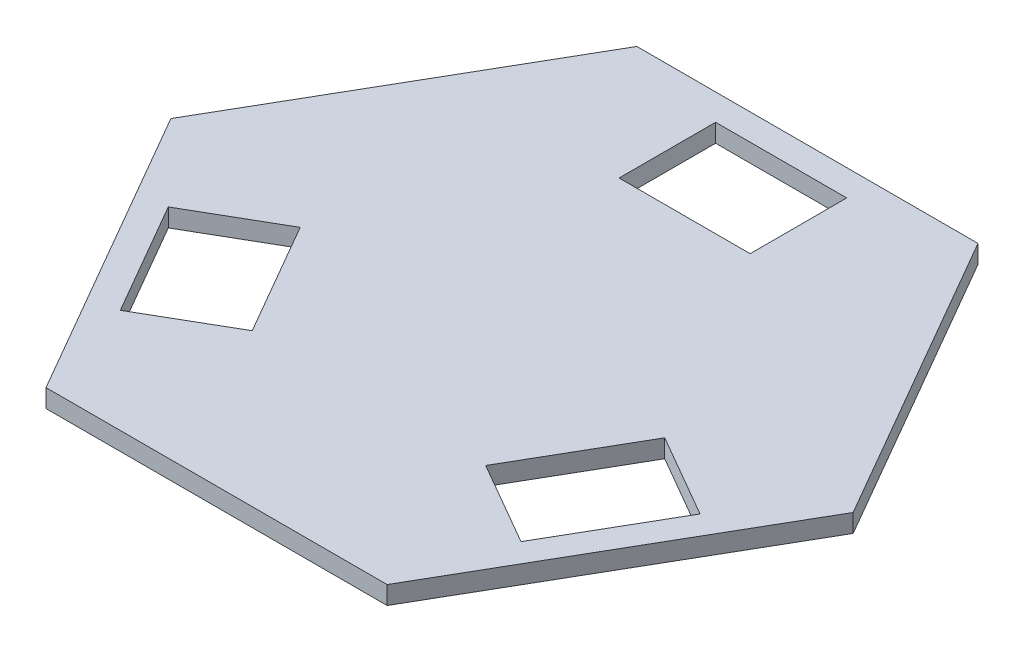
ISO-10303-21;
HEADER;
FILE_DESCRIPTION(('STEP AP214'),'2;1');
FILE_NAME('part.step','',(''),(''),'','','');
FILE_SCHEMA(('AUTOMOTIVE_DESIGN { 1 0 10303 214 1 1 1 1 }'));
ENDSEC;
DATA;
#1=APPLICATION_CONTEXT('core data for automotive mechanical design processes');
#2=APPLICATION_PROTOCOL_DEFINITION('international standard','automotive_design',2000,#1);
#3=PRODUCT_CONTEXT('',#1,'mechanical');
#4=PRODUCT('Part','Part','',(#3));
#5=PRODUCT_RELATED_PRODUCT_CATEGORY('part','',(#4));
#6=PRODUCT_DEFINITION_FORMATION('','',#4);
#7=PRODUCT_DEFINITION_CONTEXT('part definition',#1,'design');
#8=PRODUCT_DEFINITION('design','',#6,#7);
#9=PRODUCT_DEFINITION_SHAPE('','',#8);
#10=(LENGTH_UNIT() NAMED_UNIT(*) SI_UNIT(.MILLI.,.METRE.));
#11=(NAMED_UNIT(*) PLANE_ANGLE_UNIT() SI_UNIT($,.RADIAN.));
#12=(NAMED_UNIT(*) SI_UNIT($,.STERADIAN.) SOLID_ANGLE_UNIT());
#13=UNCERTAINTY_MEASURE_WITH_UNIT(LENGTH_MEASURE(1.E-05),#10,'distance_accuracy_value','');
#14=(GEOMETRIC_REPRESENTATION_CONTEXT(3) GLOBAL_UNCERTAINTY_ASSIGNED_CONTEXT((#13)) GLOBAL_UNIT_ASSIGNED_CONTEXT((#10,
#11,#12)) REPRESENTATION_CONTEXT('',''));
#15=CARTESIAN_POINT('',(0.,0.,0.));
#16=DIRECTION('',(0.,0.,1.));
#17=DIRECTION('',(1.,0.,0.));
#18=AXIS2_PLACEMENT_3D('',#15,#16,#17);
#19=CARTESIAN_POINT('',(0.,2.,0.));
#20=DIRECTION('',(0.,1.,0.));
#21=DIRECTION('',(0.,0.,1.));
#22=AXIS2_PLACEMENT_3D('',#19,#20,#21);
#23=PLANE('',#22);
#24=DIRECTION('',(0.5,0.,-0.866025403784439));
#25=VECTOR('',#24,1.);
#26=CARTESIAN_POINT('',(18.7638837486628,2.,32.5));
#27=LINE('',#26,#25);
#28=CARTESIAN_POINT('',(18.7638837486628,2.,32.5));
#29=VERTEX_POINT('',#28);
#30=CARTESIAN_POINT('',(37.5277674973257,2.,0.));
#31=VERTEX_POINT('',#30);
#32=EDGE_CURVE('E260',#29,#31,#27,.T.);
#33=ORIENTED_EDGE('',*,*,#32,.T.);
#34=DIRECTION('',(-0.5,0.,-0.866025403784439));
#35=VECTOR('',#34,1.);
#36=CARTESIAN_POINT('',(37.5277674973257,2.,0.));
#37=LINE('',#36,#35);
#38=CARTESIAN_POINT('',(18.7638837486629,2.,-32.5));
#39=VERTEX_POINT('',#38);
#40=EDGE_CURVE('E263',#31,#39,#37,.T.);
#41=ORIENTED_EDGE('',*,*,#40,.T.);
#42=DIRECTION('',(-1.,0.,0.));
#43=VECTOR('',#42,1.);
#44=CARTESIAN_POINT('',(18.7638837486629,2.,-32.5));
#45=LINE('',#44,#43);
#46=CARTESIAN_POINT('',(-18.7638837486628,2.,-32.5));
#47=VERTEX_POINT('',#46);
#48=EDGE_CURVE('E266',#39,#47,#45,.T.);
#49=ORIENTED_EDGE('',*,*,#48,.T.);
#50=DIRECTION('',(-0.5,0.,0.866025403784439));
#51=VECTOR('',#50,1.);
#52=CARTESIAN_POINT('',(-18.7638837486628,2.,-32.5));
#53=LINE('',#52,#51);
#54=CARTESIAN_POINT('',(-37.5277674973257,2.,0.));
#55=VERTEX_POINT('',#54);
#56=EDGE_CURVE('E268',#47,#55,#53,.T.);
#57=ORIENTED_EDGE('',*,*,#56,.T.);
#58=DIRECTION('',(0.5,0.,0.866025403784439));
#59=VECTOR('',#58,1.);
#60=CARTESIAN_POINT('',(-37.5277674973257,2.,0.));
#61=LINE('',#60,#59);
#62=CARTESIAN_POINT('',(-18.7638837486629,2.,32.5));
#63=VERTEX_POINT('',#62);
#64=EDGE_CURVE('E270',#55,#63,#61,.T.);
#65=ORIENTED_EDGE('',*,*,#64,.T.);
#66=DIRECTION('',(1.,0.,0.));
#67=VECTOR('',#66,1.);
#68=CARTESIAN_POINT('',(-18.7638837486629,2.,32.5));
#69=LINE('',#68,#67);
#70=EDGE_CURVE('E272',#63,#29,#69,.T.);
#71=ORIENTED_EDGE('',*,*,#70,.T.);
#72=EDGE_LOOP('',(#33,#41,#49,#57,#65,#71));
#73=FACE_BOUND('',#72,.T.);
#74=DIRECTION('',(1.,0.,0.));
#75=VECTOR('',#74,1.);
#76=CARTESIAN_POINT('',(7.20922673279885,2.,-18.9892267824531));
#77=LINE('',#76,#75);
#78=CARTESIAN_POINT('',(-7.20922673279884,2.,-18.9892267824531));
#79=VERTEX_POINT('',#78);
#80=CARTESIAN_POINT('',(7.20922673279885,2.,-18.9892267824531));
#81=VERTEX_POINT('',#80);
#82=EDGE_CURVE('E231',#79,#81,#77,.T.);
#83=ORIENTED_EDGE('',*,*,#82,.F.);
#84=DIRECTION('',(0.,0.,1.));
#85=VECTOR('',#84,1.);
#86=CARTESIAN_POINT('',(-7.20922673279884,2.,-29.6107732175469));
#87=LINE('',#86,#85);
#88=CARTESIAN_POINT('',(-7.20922673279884,2.,-29.6107732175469));
#89=VERTEX_POINT('',#88);
#90=EDGE_CURVE('E229',#89,#79,#87,.T.);
#91=ORIENTED_EDGE('',*,*,#90,.F.);
#92=DIRECTION('',(-1.,0.,0.));
#93=VECTOR('',#92,1.);
#94=CARTESIAN_POINT('',(7.20922673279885,2.,-29.6107732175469));
#95=LINE('',#94,#93);
#96=CARTESIAN_POINT('',(7.20922673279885,2.,-29.6107732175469));
#97=VERTEX_POINT('',#96);
#98=EDGE_CURVE('E237',#97,#89,#95,.T.);
#99=ORIENTED_EDGE('',*,*,#98,.F.);
#100=DIRECTION('',(0.,0.,-1.));
#101=VECTOR('',#100,1.);
#102=CARTESIAN_POINT('',(7.20922673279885,2.,-29.6107732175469));
#103=LINE('',#102,#101);
#104=EDGE_CURVE('E234',#81,#97,#103,.T.);
#105=ORIENTED_EDGE('',*,*,#104,.F.);
#106=EDGE_LOOP('',(#83,#91,#99,#105));
#107=FACE_BOUND('',#106,.T.);
#108=DIRECTION('',(-0.5,0.,0.866025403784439));
#109=VECTOR('',#108,1.);
#110=CARTESIAN_POINT('',(12.8405394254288,2.,15.7379868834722));
#111=LINE('',#110,#109);
#112=CARTESIAN_POINT('',(20.0497661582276,2.,3.25123989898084));
#113=VERTEX_POINT('',#112);
#114=CARTESIAN_POINT('',(12.8405394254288,2.,15.7379868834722));
#115=VERTEX_POINT('',#114);
#116=EDGE_CURVE('E200',#113,#115,#111,.T.);
#117=ORIENTED_EDGE('',*,*,#116,.F.);
#118=DIRECTION('',(-0.866025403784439,0.,-0.5));
#119=VECTOR('',#118,1.);
#120=CARTESIAN_POINT('',(29.248295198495,2.,8.56201311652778));
#121=LINE('',#120,#119);
#122=CARTESIAN_POINT('',(29.248295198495,2.,8.56201311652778));
#123=VERTEX_POINT('',#122);
#124=EDGE_CURVE('E198',#123,#113,#121,.T.);
#125=ORIENTED_EDGE('',*,*,#124,.F.);
#126=DIRECTION('',(0.5,0.,-0.866025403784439));
#127=VECTOR('',#126,1.);
#128=CARTESIAN_POINT('',(22.0390684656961,2.,21.0487601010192));
#129=LINE('',#128,#127);
#130=CARTESIAN_POINT('',(22.0390684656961,2.,21.0487601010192));
#131=VERTEX_POINT('',#130);
#132=EDGE_CURVE('E206',#131,#123,#129,.T.);
#133=ORIENTED_EDGE('',*,*,#132,.F.);
#134=DIRECTION('',(0.866025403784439,0.,0.5));
#135=VECTOR('',#134,1.);
#136=CARTESIAN_POINT('',(22.0390684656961,2.,21.0487601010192));
#137=LINE('',#136,#135);
#138=EDGE_CURVE('E203',#115,#131,#137,.T.);
#139=ORIENTED_EDGE('',*,*,#138,.F.);
#140=EDGE_LOOP('',(#117,#125,#133,#139));
#141=FACE_BOUND('',#140,.T.);
#142=DIRECTION('',(-0.5,0.,-0.866025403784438));
#143=VECTOR('',#142,1.);
#144=CARTESIAN_POINT('',(-20.0497661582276,2.,3.25123989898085));
#145=LINE('',#144,#143);
#146=CARTESIAN_POINT('',(-12.8405394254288,2.,15.7379868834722));
#147=VERTEX_POINT('',#146);
#148=CARTESIAN_POINT('',(-20.0497661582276,2.,3.25123989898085));
#149=VERTEX_POINT('',#148);
#150=EDGE_CURVE('E170',#147,#149,#145,.T.);
#151=ORIENTED_EDGE('',*,*,#150,.F.);
#152=DIRECTION('',(0.866025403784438,0.,-0.5));
#153=VECTOR('',#152,1.);
#154=CARTESIAN_POINT('',(-22.0390684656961,2.,21.0487601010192));
#155=LINE('',#154,#153);
#156=CARTESIAN_POINT('',(-22.0390684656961,2.,21.0487601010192));
#157=VERTEX_POINT('',#156);
#158=EDGE_CURVE('E162',#157,#147,#155,.T.);
#159=ORIENTED_EDGE('',*,*,#158,.F.);
#160=DIRECTION('',(0.5,0.,0.866025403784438));
#161=VECTOR('',#160,1.);
#162=CARTESIAN_POINT('',(-29.248295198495,2.,8.56201311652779));
#163=LINE('',#162,#161);
#164=CARTESIAN_POINT('',(-29.248295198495,2.,8.56201311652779));
#165=VERTEX_POINT('',#164);
#166=EDGE_CURVE('E184',#165,#157,#163,.T.);
#167=ORIENTED_EDGE('',*,*,#166,.F.);
#168=DIRECTION('',(-0.866025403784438,0.,0.5));
#169=VECTOR('',#168,1.);
#170=CARTESIAN_POINT('',(-29.248295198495,2.,8.56201311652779));
#171=LINE('',#170,#169);
#172=EDGE_CURVE('E182',#149,#165,#171,.T.);
#173=ORIENTED_EDGE('',*,*,#172,.F.);
#174=EDGE_LOOP('',(#151,#159,#167,#173));
#175=FACE_BOUND('',#174,.T.);
#176=ADVANCED_FACE('F37',(#73,#107,#141,#175),#23,.T.);
#177=CARTESIAN_POINT('',(0.,0.,0.));
#178=DIRECTION('',(0.,1.,0.));
#179=DIRECTION('',(0.,0.,1.));
#180=AXIS2_PLACEMENT_3D('',#177,#178,#179);
#181=PLANE('',#180);
#182=DIRECTION('',(-0.866025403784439,0.,-0.5));
#183=VECTOR('',#182,1.);
#184=CARTESIAN_POINT('',(29.248295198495,0.,8.56201311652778));
#185=LINE('',#184,#183);
#186=CARTESIAN_POINT('',(29.248295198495,0.,8.56201311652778));
#187=VERTEX_POINT('',#186);
#188=CARTESIAN_POINT('',(20.0497661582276,0.,3.25123989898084));
#189=VERTEX_POINT('',#188);
#190=EDGE_CURVE('E178',#187,#189,#185,.T.);
#191=ORIENTED_EDGE('',*,*,#190,.T.);
#192=DIRECTION('',(-0.5,0.,0.866025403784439));
#193=VECTOR('',#192,1.);
#194=CARTESIAN_POINT('',(12.8405394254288,0.,15.7379868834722));
#195=LINE('',#194,#193);
#196=CARTESIAN_POINT('',(12.8405394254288,0.,15.7379868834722));
#197=VERTEX_POINT('',#196);
#198=EDGE_CURVE('E211',#189,#197,#195,.T.);
#199=ORIENTED_EDGE('',*,*,#198,.T.);
#200=DIRECTION('',(0.866025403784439,0.,0.5));
#201=VECTOR('',#200,1.);
#202=CARTESIAN_POINT('',(22.0390684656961,0.,21.0487601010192));
#203=LINE('',#202,#201);
#204=CARTESIAN_POINT('',(22.0390684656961,0.,21.0487601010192));
#205=VERTEX_POINT('',#204);
#206=EDGE_CURVE('E214',#197,#205,#203,.T.);
#207=ORIENTED_EDGE('',*,*,#206,.T.);
#208=DIRECTION('',(0.5,0.,-0.866025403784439));
#209=VECTOR('',#208,1.);
#210=CARTESIAN_POINT('',(22.0390684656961,0.,21.0487601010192));
#211=LINE('',#210,#209);
#212=EDGE_CURVE('E201',#205,#187,#211,.T.);
#213=ORIENTED_EDGE('',*,*,#212,.T.);
#214=EDGE_LOOP('',(#191,#199,#207,#213));
#215=FACE_BOUND('',#214,.T.);
#216=DIRECTION('',(0.5,0.,-0.866025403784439));
#217=VECTOR('',#216,1.);
#218=CARTESIAN_POINT('',(18.7638837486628,0.,32.5));
#219=LINE('',#218,#217);
#220=CARTESIAN_POINT('',(18.7638837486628,0.,32.5));
#221=VERTEX_POINT('',#220);
#222=CARTESIAN_POINT('',(37.5277674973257,0.,0.));
#223=VERTEX_POINT('',#222);
#224=EDGE_CURVE('E259',#221,#223,#219,.T.);
#225=ORIENTED_EDGE('',*,*,#224,.F.);
#226=DIRECTION('',(1.,0.,0.));
#227=VECTOR('',#226,1.);
#228=CARTESIAN_POINT('',(-18.7638837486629,0.,32.5));
#229=LINE('',#228,#227);
#230=CARTESIAN_POINT('',(-18.7638837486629,0.,32.5));
#231=VERTEX_POINT('',#230);
#232=EDGE_CURVE('E264',#231,#221,#229,.T.);
#233=ORIENTED_EDGE('',*,*,#232,.F.);
#234=DIRECTION('',(0.5,0.,0.866025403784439));
#235=VECTOR('',#234,1.);
#236=CARTESIAN_POINT('',(-37.5277674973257,0.,0.));
#237=LINE('',#236,#235);
#238=CARTESIAN_POINT('',(-37.5277674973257,0.,0.));
#239=VERTEX_POINT('',#238);
#240=EDGE_CURVE('E283',#239,#231,#237,.T.);
#241=ORIENTED_EDGE('',*,*,#240,.F.);
#242=DIRECTION('',(-0.5,0.,0.866025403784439));
#243=VECTOR('',#242,1.);
#244=CARTESIAN_POINT('',(-18.7638837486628,0.,-32.5));
#245=LINE('',#244,#243);
#246=CARTESIAN_POINT('',(-18.7638837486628,0.,-32.5));
#247=VERTEX_POINT('',#246);
#248=EDGE_CURVE('E281',#247,#239,#245,.T.);
#249=ORIENTED_EDGE('',*,*,#248,.F.);
#250=DIRECTION('',(-1.,0.,0.));
#251=VECTOR('',#250,1.);
#252=CARTESIAN_POINT('',(18.7638837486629,0.,-32.5));
#253=LINE('',#252,#251);
#254=CARTESIAN_POINT('',(18.7638837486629,0.,-32.5));
#255=VERTEX_POINT('',#254);
#256=EDGE_CURVE('E279',#255,#247,#253,.T.);
#257=ORIENTED_EDGE('',*,*,#256,.F.);
#258=DIRECTION('',(-0.5,0.,-0.866025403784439));
#259=VECTOR('',#258,1.);
#260=CARTESIAN_POINT('',(37.5277674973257,0.,0.));
#261=LINE('',#260,#259);
#262=EDGE_CURVE('E277',#223,#255,#261,.T.);
#263=ORIENTED_EDGE('',*,*,#262,.F.);
#264=EDGE_LOOP('',(#225,#233,#241,#249,#257,#263));
#265=FACE_BOUND('',#264,.T.);
#266=DIRECTION('',(0.,0.,1.));
#267=VECTOR('',#266,1.);
#268=CARTESIAN_POINT('',(-7.20922673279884,0.,-29.6107732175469));
#269=LINE('',#268,#267);
#270=CARTESIAN_POINT('',(-7.20922673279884,0.,-29.6107732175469));
#271=VERTEX_POINT('',#270);
#272=CARTESIAN_POINT('',(-7.20922673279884,0.,-18.9892267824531));
#273=VERTEX_POINT('',#272);
#274=EDGE_CURVE('E228',#271,#273,#269,.T.);
#275=ORIENTED_EDGE('',*,*,#274,.T.);
#276=DIRECTION('',(1.,0.,0.));
#277=VECTOR('',#276,1.);
#278=CARTESIAN_POINT('',(7.20922673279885,0.,-18.9892267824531));
#279=LINE('',#278,#277);
#280=CARTESIAN_POINT('',(7.20922673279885,0.,-18.9892267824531));
#281=VERTEX_POINT('',#280);
#282=EDGE_CURVE('E242',#273,#281,#279,.T.);
#283=ORIENTED_EDGE('',*,*,#282,.T.);
#284=DIRECTION('',(0.,0.,-1.));
#285=VECTOR('',#284,1.);
#286=CARTESIAN_POINT('',(7.20922673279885,0.,-29.6107732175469));
#287=LINE('',#286,#285);
#288=CARTESIAN_POINT('',(7.20922673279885,0.,-29.6107732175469));
#289=VERTEX_POINT('',#288);
#290=EDGE_CURVE('E245',#281,#289,#287,.T.);
#291=ORIENTED_EDGE('',*,*,#290,.T.);
#292=DIRECTION('',(-1.,0.,0.));
#293=VECTOR('',#292,1.);
#294=CARTESIAN_POINT('',(7.20922673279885,0.,-29.6107732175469));
#295=LINE('',#294,#293);
#296=EDGE_CURVE('E232',#289,#271,#295,.T.);
#297=ORIENTED_EDGE('',*,*,#296,.T.);
#298=EDGE_LOOP('',(#275,#283,#291,#297));
#299=FACE_BOUND('',#298,.T.);
#300=DIRECTION('',(0.866025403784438,0.,-0.5));
#301=VECTOR('',#300,1.);
#302=CARTESIAN_POINT('',(-22.0390684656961,0.,21.0487601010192));
#303=LINE('',#302,#301);
#304=CARTESIAN_POINT('',(-22.0390684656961,0.,21.0487601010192));
#305=VERTEX_POINT('',#304);
#306=CARTESIAN_POINT('',(-12.8405394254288,0.,15.7379868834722));
#307=VERTEX_POINT('',#306);
#308=EDGE_CURVE('E60',#305,#307,#303,.T.);
#309=ORIENTED_EDGE('',*,*,#308,.T.);
#310=DIRECTION('',(-0.5,0.,-0.866025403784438));
#311=VECTOR('',#310,1.);
#312=CARTESIAN_POINT('',(-20.0497661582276,0.,3.25123989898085));
#313=LINE('',#312,#311);
#314=CARTESIAN_POINT('',(-20.0497661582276,0.,3.25123989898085));
#315=VERTEX_POINT('',#314);
#316=EDGE_CURVE('E177',#307,#315,#313,.T.);
#317=ORIENTED_EDGE('',*,*,#316,.T.);
#318=DIRECTION('',(-0.866025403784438,0.,0.5));
#319=VECTOR('',#318,1.);
#320=CARTESIAN_POINT('',(-29.248295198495,0.,8.56201311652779));
#321=LINE('',#320,#319);
#322=CARTESIAN_POINT('',(-29.248295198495,0.,8.56201311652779));
#323=VERTEX_POINT('',#322);
#324=EDGE_CURVE('E190',#315,#323,#321,.T.);
#325=ORIENTED_EDGE('',*,*,#324,.T.);
#326=DIRECTION('',(0.5,0.,0.866025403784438));
#327=VECTOR('',#326,1.);
#328=CARTESIAN_POINT('',(-29.248295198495,0.,8.56201311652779));
#329=LINE('',#328,#327);
#330=EDGE_CURVE('E171',#323,#305,#329,.T.);
#331=ORIENTED_EDGE('',*,*,#330,.T.);
#332=EDGE_LOOP('',(#309,#317,#325,#331));
#333=FACE_BOUND('',#332,.T.);
#334=ADVANCED_FACE('F307',(#215,#265,#299,#333),#181,.F.);
#335=CARTESIAN_POINT('',(18.7638837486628,2.,32.5));
#336=DIRECTION('',(-0.866025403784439,0.,-0.5));
#337=DIRECTION('',(-0.5,0.,0.866025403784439));
#338=AXIS2_PLACEMENT_3D('',#335,#336,#337);
#339=PLANE('',#338);
#340=ORIENTED_EDGE('',*,*,#224,.T.);
#341=DIRECTION('',(0.,-1.,0.));
#342=VECTOR('',#341,1.);
#343=CARTESIAN_POINT('',(37.5277674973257,2.,0.));
#344=LINE('',#343,#342);
#345=EDGE_CURVE('E11',#31,#223,#344,.T.);
#346=ORIENTED_EDGE('',*,*,#345,.F.);
#347=ORIENTED_EDGE('',*,*,#32,.F.);
#348=DIRECTION('',(0.,-1.,0.));
#349=VECTOR('',#348,1.);
#350=CARTESIAN_POINT('',(18.7638837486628,2.,32.5));
#351=LINE('',#350,#349);
#352=EDGE_CURVE('E274',#29,#221,#351,.T.);
#353=ORIENTED_EDGE('',*,*,#352,.T.);
#354=EDGE_LOOP('',(#340,#346,#347,#353));
#355=FACE_BOUND('',#354,.T.);
#356=ADVANCED_FACE('F39',(#355),#339,.F.);
#357=CARTESIAN_POINT('',(37.5277674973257,2.,0.));
#358=DIRECTION('',(-0.866025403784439,0.,0.5));
#359=DIRECTION('',(0.5,0.,0.866025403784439));
#360=AXIS2_PLACEMENT_3D('',#357,#358,#359);
#361=PLANE('',#360);
#362=ORIENTED_EDGE('',*,*,#262,.T.);
#363=DIRECTION('',(0.,-1.,0.));
#364=VECTOR('',#363,1.);
#365=CARTESIAN_POINT('',(18.7638837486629,2.,-32.5));
#366=LINE('',#365,#364);
#367=EDGE_CURVE('E45',#39,#255,#366,.T.);
#368=ORIENTED_EDGE('',*,*,#367,.F.);
#369=ORIENTED_EDGE('',*,*,#40,.F.);
#370=ORIENTED_EDGE('',*,*,#345,.T.);
#371=EDGE_LOOP('',(#362,#368,#369,#370));
#372=FACE_BOUND('',#371,.T.);
#373=ADVANCED_FACE('F325',(#372),#361,.F.);
#374=CARTESIAN_POINT('',(18.7638837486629,2.,-32.5));
#375=DIRECTION('',(0.,0.,1.));
#376=DIRECTION('',(1.,0.,0.));
#377=AXIS2_PLACEMENT_3D('',#374,#375,#376);
#378=PLANE('',#377);
#379=ORIENTED_EDGE('',*,*,#256,.T.);
#380=DIRECTION('',(0.,-1.,0.));
#381=VECTOR('',#380,1.);
#382=CARTESIAN_POINT('',(-18.7638837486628,2.,-32.5));
#383=LINE('',#382,#381);
#384=EDGE_CURVE('E294',#47,#247,#383,.T.);
#385=ORIENTED_EDGE('',*,*,#384,.F.);
#386=ORIENTED_EDGE('',*,*,#48,.F.);
#387=ORIENTED_EDGE('',*,*,#367,.T.);
#388=EDGE_LOOP('',(#379,#385,#386,#387));
#389=FACE_BOUND('',#388,.T.);
#390=ADVANCED_FACE('F301',(#389),#378,.F.);
#391=CARTESIAN_POINT('',(-18.7638837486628,2.,-32.5));
#392=DIRECTION('',(0.866025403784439,0.,0.5));
#393=DIRECTION('',(0.5,0.,-0.866025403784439));
#394=AXIS2_PLACEMENT_3D('',#391,#392,#393);
#395=PLANE('',#394);
#396=ORIENTED_EDGE('',*,*,#248,.T.);
#397=DIRECTION('',(0.,-1.,0.));
#398=VECTOR('',#397,1.);
#399=CARTESIAN_POINT('',(-37.5277674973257,2.,0.));
#400=LINE('',#399,#398);
#401=EDGE_CURVE('E291',#55,#239,#400,.T.);
#402=ORIENTED_EDGE('',*,*,#401,.F.);
#403=ORIENTED_EDGE('',*,*,#56,.F.);
#404=ORIENTED_EDGE('',*,*,#384,.T.);
#405=EDGE_LOOP('',(#396,#402,#403,#404));
#406=FACE_BOUND('',#405,.T.);
#407=ADVANCED_FACE('F313',(#406),#395,.F.);
#408=CARTESIAN_POINT('',(-37.5277674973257,2.,0.));
#409=DIRECTION('',(0.866025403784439,0.,-0.5));
#410=DIRECTION('',(-0.5,0.,-0.866025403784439));
#411=AXIS2_PLACEMENT_3D('',#408,#409,#410);
#412=PLANE('',#411);
#413=ORIENTED_EDGE('',*,*,#240,.T.);
#414=DIRECTION('',(0.,-1.,0.));
#415=VECTOR('',#414,1.);
#416=CARTESIAN_POINT('',(-18.7638837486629,2.,32.5));
#417=LINE('',#416,#415);
#418=EDGE_CURVE('E288',#63,#231,#417,.T.);
#419=ORIENTED_EDGE('',*,*,#418,.F.);
#420=ORIENTED_EDGE('',*,*,#64,.F.);
#421=ORIENTED_EDGE('',*,*,#401,.T.);
#422=EDGE_LOOP('',(#413,#419,#420,#421));
#423=FACE_BOUND('',#422,.T.);
#424=ADVANCED_FACE('F317',(#423),#412,.F.);
#425=CARTESIAN_POINT('',(-18.7638837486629,2.,32.5));
#426=DIRECTION('',(0.,0.,-1.));
#427=DIRECTION('',(-1.,0.,0.));
#428=AXIS2_PLACEMENT_3D('',#425,#426,#427);
#429=PLANE('',#428);
#430=ORIENTED_EDGE('',*,*,#232,.T.);
#431=ORIENTED_EDGE('',*,*,#352,.F.);
#432=ORIENTED_EDGE('',*,*,#70,.F.);
#433=ORIENTED_EDGE('',*,*,#418,.T.);
#434=EDGE_LOOP('',(#430,#431,#432,#433));
#435=FACE_BOUND('',#434,.T.);
#436=ADVANCED_FACE('F328',(#435),#429,.F.);
#437=CARTESIAN_POINT('',(-7.20922673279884,2.,-29.6107732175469));
#438=DIRECTION('',(1.,0.,0.));
#439=DIRECTION('',(0.,0.,-1.));
#440=AXIS2_PLACEMENT_3D('',#437,#438,#439);
#441=PLANE('',#440);
#442=ORIENTED_EDGE('',*,*,#274,.F.);
#443=DIRECTION('',(0.,-1.,0.));
#444=VECTOR('',#443,1.);
#445=CARTESIAN_POINT('',(-7.20922673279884,2.,-29.6107732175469));
#446=LINE('',#445,#444);
#447=EDGE_CURVE('E239',#89,#271,#446,.T.);
#448=ORIENTED_EDGE('',*,*,#447,.F.);
#449=ORIENTED_EDGE('',*,*,#90,.T.);
#450=DIRECTION('',(0.,-1.,0.));
#451=VECTOR('',#450,1.);
#452=CARTESIAN_POINT('',(-7.20922673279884,2.,-18.9892267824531));
#453=LINE('',#452,#451);
#454=EDGE_CURVE('E256',#79,#273,#453,.T.);
#455=ORIENTED_EDGE('',*,*,#454,.T.);
#456=EDGE_LOOP('',(#442,#448,#449,#455));
#457=FACE_BOUND('',#456,.T.);
#458=ADVANCED_FACE('F330',(#457),#441,.T.);
#459=CARTESIAN_POINT('',(7.20922673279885,2.,-18.9892267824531));
#460=DIRECTION('',(0.,0.,-1.));
#461=DIRECTION('',(-1.,0.,0.));
#462=AXIS2_PLACEMENT_3D('',#459,#460,#461);
#463=PLANE('',#462);
#464=ORIENTED_EDGE('',*,*,#282,.F.);
#465=ORIENTED_EDGE('',*,*,#454,.F.);
#466=ORIENTED_EDGE('',*,*,#82,.T.);
#467=DIRECTION('',(0.,-1.,0.));
#468=VECTOR('',#467,1.);
#469=CARTESIAN_POINT('',(7.20922673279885,2.,-18.9892267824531));
#470=LINE('',#469,#468);
#471=EDGE_CURVE('E254',#81,#281,#470,.T.);
#472=ORIENTED_EDGE('',*,*,#471,.T.);
#473=EDGE_LOOP('',(#464,#465,#466,#472));
#474=FACE_BOUND('',#473,.T.);
#475=ADVANCED_FACE('F336',(#474),#463,.T.);
#476=CARTESIAN_POINT('',(7.20922673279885,2.,-29.6107732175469));
#477=DIRECTION('',(-1.,0.,0.));
#478=DIRECTION('',(0.,0.,1.));
#479=AXIS2_PLACEMENT_3D('',#476,#477,#478);
#480=PLANE('',#479);
#481=ORIENTED_EDGE('',*,*,#290,.F.);
#482=ORIENTED_EDGE('',*,*,#471,.F.);
#483=ORIENTED_EDGE('',*,*,#104,.T.);
#484=DIRECTION('',(0.,-1.,0.));
#485=VECTOR('',#484,1.);
#486=CARTESIAN_POINT('',(7.20922673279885,2.,-29.6107732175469));
#487=LINE('',#486,#485);
#488=EDGE_CURVE('E252',#97,#289,#487,.T.);
#489=ORIENTED_EDGE('',*,*,#488,.T.);
#490=EDGE_LOOP('',(#481,#482,#483,#489));
#491=FACE_BOUND('',#490,.T.);
#492=ADVANCED_FACE('F350',(#491),#480,.T.);
#493=CARTESIAN_POINT('',(7.20922673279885,2.,-29.6107732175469));
#494=DIRECTION('',(0.,0.,1.));
#495=DIRECTION('',(1.,0.,0.));
#496=AXIS2_PLACEMENT_3D('',#493,#494,#495);
#497=PLANE('',#496);
#498=ORIENTED_EDGE('',*,*,#296,.F.);
#499=ORIENTED_EDGE('',*,*,#488,.F.);
#500=ORIENTED_EDGE('',*,*,#98,.T.);
#501=ORIENTED_EDGE('',*,*,#447,.T.);
#502=EDGE_LOOP('',(#498,#499,#500,#501));
#503=FACE_BOUND('',#502,.T.);
#504=ADVANCED_FACE('F354',(#503),#497,.T.);
#505=CARTESIAN_POINT('',(29.248295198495,2.,8.56201311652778));
#506=DIRECTION('',(-0.5,0.,0.866025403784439));
#507=DIRECTION('',(0.866025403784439,0.,0.5));
#508=AXIS2_PLACEMENT_3D('',#505,#506,#507);
#509=PLANE('',#508);
#510=ORIENTED_EDGE('',*,*,#190,.F.);
#511=DIRECTION('',(0.,-1.,0.));
#512=VECTOR('',#511,1.);
#513=CARTESIAN_POINT('',(29.248295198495,2.,8.56201311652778));
#514=LINE('',#513,#512);
#515=EDGE_CURVE('E208',#123,#187,#514,.T.);
#516=ORIENTED_EDGE('',*,*,#515,.F.);
#517=ORIENTED_EDGE('',*,*,#124,.T.);
#518=DIRECTION('',(0.,-1.,0.));
#519=VECTOR('',#518,1.);
#520=CARTESIAN_POINT('',(20.0497661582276,2.,3.25123989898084));
#521=LINE('',#520,#519);
#522=EDGE_CURVE('E225',#113,#189,#521,.T.);
#523=ORIENTED_EDGE('',*,*,#522,.T.);
#524=EDGE_LOOP('',(#510,#516,#517,#523));
#525=FACE_BOUND('',#524,.T.);
#526=ADVANCED_FACE('F358',(#525),#509,.T.);
#527=CARTESIAN_POINT('',(12.8405394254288,2.,15.7379868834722));
#528=DIRECTION('',(0.866025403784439,0.,0.5));
#529=DIRECTION('',(0.5,0.,-0.866025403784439));
#530=AXIS2_PLACEMENT_3D('',#527,#528,#529);
#531=PLANE('',#530);
#532=ORIENTED_EDGE('',*,*,#198,.F.);
#533=ORIENTED_EDGE('',*,*,#522,.F.);
#534=ORIENTED_EDGE('',*,*,#116,.T.);
#535=DIRECTION('',(0.,-1.,0.));
#536=VECTOR('',#535,1.);
#537=CARTESIAN_POINT('',(12.8405394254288,2.,15.7379868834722));
#538=LINE('',#537,#536);
#539=EDGE_CURVE('E223',#115,#197,#538,.T.);
#540=ORIENTED_EDGE('',*,*,#539,.T.);
#541=EDGE_LOOP('',(#532,#533,#534,#540));
#542=FACE_BOUND('',#541,.T.);
#543=ADVANCED_FACE('F362',(#542),#531,.T.);
#544=CARTESIAN_POINT('',(22.0390684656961,2.,21.0487601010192));
#545=DIRECTION('',(0.5,0.,-0.866025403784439));
#546=DIRECTION('',(-0.866025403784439,0.,-0.5));
#547=AXIS2_PLACEMENT_3D('',#544,#545,#546);
#548=PLANE('',#547);
#549=ORIENTED_EDGE('',*,*,#206,.F.);
#550=ORIENTED_EDGE('',*,*,#539,.F.);
#551=ORIENTED_EDGE('',*,*,#138,.T.);
#552=DIRECTION('',(0.,-1.,0.));
#553=VECTOR('',#552,1.);
#554=CARTESIAN_POINT('',(22.0390684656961,2.,21.0487601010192));
#555=LINE('',#554,#553);
#556=EDGE_CURVE('E221',#131,#205,#555,.T.);
#557=ORIENTED_EDGE('',*,*,#556,.T.);
#558=EDGE_LOOP('',(#549,#550,#551,#557));
#559=FACE_BOUND('',#558,.T.);
#560=ADVANCED_FACE('F366',(#559),#548,.T.);
#561=CARTESIAN_POINT('',(22.0390684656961,2.,21.0487601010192));
#562=DIRECTION('',(-0.866025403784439,0.,-0.5));
#563=DIRECTION('',(-0.5,0.,0.866025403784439));
#564=AXIS2_PLACEMENT_3D('',#561,#562,#563);
#565=PLANE('',#564);
#566=ORIENTED_EDGE('',*,*,#212,.F.);
#567=ORIENTED_EDGE('',*,*,#556,.F.);
#568=ORIENTED_EDGE('',*,*,#132,.T.);
#569=ORIENTED_EDGE('',*,*,#515,.T.);
#570=EDGE_LOOP('',(#566,#567,#568,#569));
#571=FACE_BOUND('',#570,.T.);
#572=ADVANCED_FACE('F370',(#571),#565,.T.);
#573=CARTESIAN_POINT('',(-22.0390684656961,2.,21.0487601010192));
#574=DIRECTION('',(-0.5,0.,-0.866025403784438));
#575=DIRECTION('',(-0.866025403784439,0.,0.5));
#576=AXIS2_PLACEMENT_3D('',#573,#574,#575);
#577=PLANE('',#576);
#578=ORIENTED_EDGE('',*,*,#308,.F.);
#579=DIRECTION('',(0.,-1.,0.));
#580=VECTOR('',#579,1.);
#581=CARTESIAN_POINT('',(-22.0390684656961,2.,21.0487601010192));
#582=LINE('',#581,#580);
#583=EDGE_CURVE('E166',#157,#305,#582,.T.);
#584=ORIENTED_EDGE('',*,*,#583,.F.);
#585=ORIENTED_EDGE('',*,*,#158,.T.);
#586=DIRECTION('',(0.,-1.,0.));
#587=VECTOR('',#586,1.);
#588=CARTESIAN_POINT('',(-12.8405394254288,2.,15.7379868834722));
#589=LINE('',#588,#587);
#590=EDGE_CURVE('E165',#147,#307,#589,.T.);
#591=ORIENTED_EDGE('',*,*,#590,.T.);
#592=EDGE_LOOP('',(#578,#584,#585,#591));
#593=FACE_BOUND('',#592,.T.);
#594=ADVANCED_FACE('F164',(#593),#577,.T.);
#595=CARTESIAN_POINT('',(-20.0497661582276,2.,3.25123989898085));
#596=DIRECTION('',(-0.866025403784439,0.,0.5));
#597=DIRECTION('',(0.5,0.,0.866025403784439));
#598=AXIS2_PLACEMENT_3D('',#595,#596,#597);
#599=PLANE('',#598);
#600=ORIENTED_EDGE('',*,*,#316,.F.);
#601=ORIENTED_EDGE('',*,*,#590,.F.);
#602=ORIENTED_EDGE('',*,*,#150,.T.);
#603=DIRECTION('',(0.,-1.,0.));
#604=VECTOR('',#603,1.);
#605=CARTESIAN_POINT('',(-20.0497661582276,2.,3.25123989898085));
#606=LINE('',#605,#604);
#607=EDGE_CURVE('E179',#149,#315,#606,.T.);
#608=ORIENTED_EDGE('',*,*,#607,.T.);
#609=EDGE_LOOP('',(#600,#601,#602,#608));
#610=FACE_BOUND('',#609,.T.);
#611=ADVANCED_FACE('F174',(#610),#599,.T.);
#612=CARTESIAN_POINT('',(-29.248295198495,2.,8.56201311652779));
#613=DIRECTION('',(0.5,0.,0.866025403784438));
#614=DIRECTION('',(0.866025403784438,0.,-0.5));
#615=AXIS2_PLACEMENT_3D('',#612,#613,#614);
#616=PLANE('',#615);
#617=ORIENTED_EDGE('',*,*,#324,.F.);
#618=ORIENTED_EDGE('',*,*,#607,.F.);
#619=ORIENTED_EDGE('',*,*,#172,.T.);
#620=DIRECTION('',(0.,-1.,0.));
#621=VECTOR('',#620,1.);
#622=CARTESIAN_POINT('',(-29.248295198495,2.,8.56201311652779));
#623=LINE('',#622,#621);
#624=EDGE_CURVE('E52',#165,#323,#623,.T.);
#625=ORIENTED_EDGE('',*,*,#624,.T.);
#626=EDGE_LOOP('',(#617,#618,#619,#625));
#627=FACE_BOUND('',#626,.T.);
#628=ADVANCED_FACE('F379',(#627),#616,.T.);
#629=CARTESIAN_POINT('',(-29.248295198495,2.,8.56201311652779));
#630=DIRECTION('',(0.866025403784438,0.,-0.5));
#631=DIRECTION('',(-0.5,0.,-0.866025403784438));
#632=AXIS2_PLACEMENT_3D('',#629,#630,#631);
#633=PLANE('',#632);
#634=ORIENTED_EDGE('',*,*,#330,.F.);
#635=ORIENTED_EDGE('',*,*,#624,.F.);
#636=ORIENTED_EDGE('',*,*,#166,.T.);
#637=ORIENTED_EDGE('',*,*,#583,.T.);
#638=EDGE_LOOP('',(#634,#635,#636,#637));
#639=FACE_BOUND('',#638,.T.);
#640=ADVANCED_FACE('F382',(#639),#633,.T.);
#641=CLOSED_SHELL('',(#176,#334,#356,#373,#390,#407,#424,#436,#458,#475,#492,#504,#526,#543,
#560,#572,#594,#611,#628,#640));
#642=MANIFOLD_SOLID_BREP('B2',#641);
#643=ADVANCED_BREP_SHAPE_REPRESENTATION('',(#18,#642),#14);
#644=SHAPE_DEFINITION_REPRESENTATION(#9,#643);
ENDSEC;
END-ISO-10303-21;
